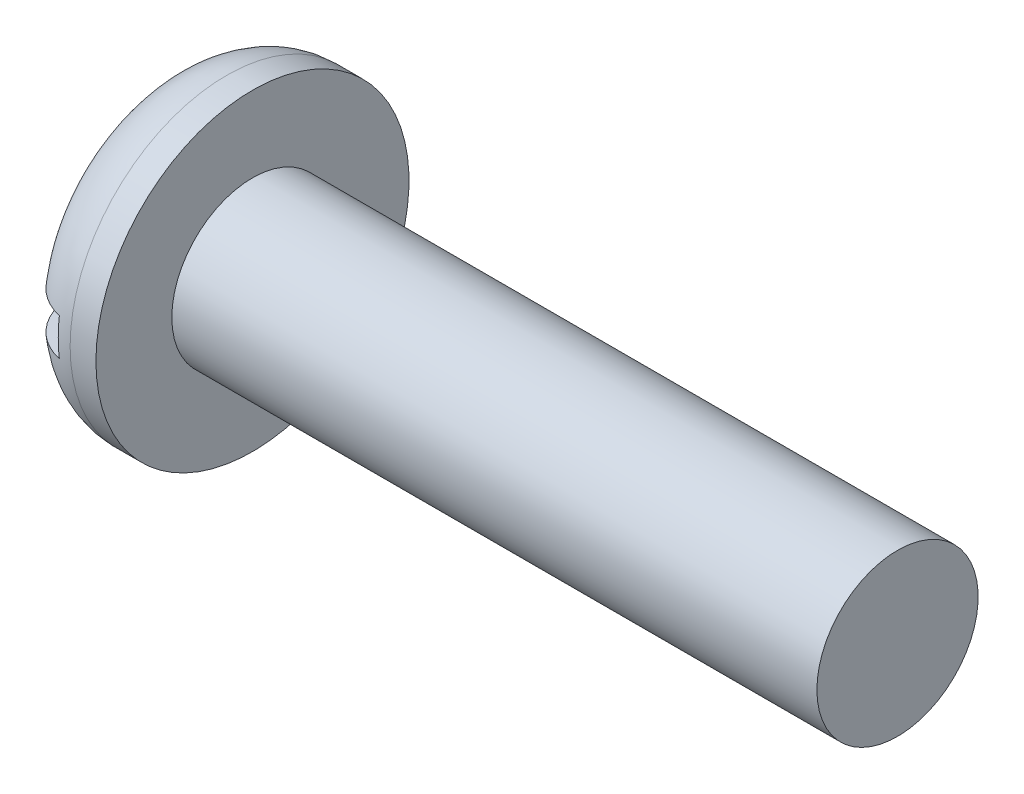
ISO-10303-21;
HEADER;
FILE_DESCRIPTION(('STEP AP214'),'2;1');
FILE_NAME('part.step','',(''),(''),'','','');
FILE_SCHEMA(('AUTOMOTIVE_DESIGN { 1 0 10303 214 1 1 1 1 }'));
ENDSEC;
DATA;
#1=APPLICATION_CONTEXT('core data for automotive mechanical design processes');
#2=APPLICATION_PROTOCOL_DEFINITION('international standard','automotive_design',2000,#1);
#3=PRODUCT_CONTEXT('',#1,'mechanical');
#4=PRODUCT('Part','Part','',(#3));
#5=PRODUCT_RELATED_PRODUCT_CATEGORY('part','',(#4));
#6=PRODUCT_DEFINITION_FORMATION('','',#4);
#7=PRODUCT_DEFINITION_CONTEXT('part definition',#1,'design');
#8=PRODUCT_DEFINITION('design','',#6,#7);
#9=PRODUCT_DEFINITION_SHAPE('','',#8);
#10=(LENGTH_UNIT() NAMED_UNIT(*) SI_UNIT(.MILLI.,.METRE.));
#11=(NAMED_UNIT(*) PLANE_ANGLE_UNIT() SI_UNIT($,.RADIAN.));
#12=(NAMED_UNIT(*) SI_UNIT($,.STERADIAN.) SOLID_ANGLE_UNIT());
#13=UNCERTAINTY_MEASURE_WITH_UNIT(LENGTH_MEASURE(1.E-05),#10,'distance_accuracy_value','');
#14=(GEOMETRIC_REPRESENTATION_CONTEXT(3) GLOBAL_UNCERTAINTY_ASSIGNED_CONTEXT((#13)) GLOBAL_UNIT_ASSIGNED_CONTEXT((#10,
#11,#12)) REPRESENTATION_CONTEXT('',''));
#15=CARTESIAN_POINT('',(0.,0.,0.));
#16=DIRECTION('',(0.,0.,1.));
#17=DIRECTION('',(1.,0.,0.));
#18=AXIS2_PLACEMENT_3D('',#15,#16,#17);
#19=CARTESIAN_POINT('',(0.,0.,0.));
#20=DIRECTION('',(-1.,0.,0.));
#21=DIRECTION('',(0.,0.,1.));
#22=AXIS2_PLACEMENT_3D('',#19,#20,#21);
#23=PLANE('',#22);
#24=DIRECTION('',(0.,0.,-1.));
#25=VECTOR('',#24,1.);
#26=CARTESIAN_POINT('',(0.,1.1049,9.2456));
#27=LINE('',#26,#25);
#28=CARTESIAN_POINT('',(0.,1.1049,5.50358569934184));
#29=VERTEX_POINT('',#28);
#30=CARTESIAN_POINT('',(0.,1.1049,-5.50358569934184));
#31=VERTEX_POINT('',#30);
#32=EDGE_CURVE('E87',#29,#31,#27,.T.);
#33=ORIENTED_EDGE('',*,*,#32,.F.);
#34=CARTESIAN_POINT('',(0.,0.,0.));
#35=DIRECTION('',(-1.,0.,0.));
#36=DIRECTION('',(0.,0.,1.));
#37=AXIS2_PLACEMENT_3D('',#34,#35,#36);
#38=CIRCLE('',#37,5.61339999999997);
#39=EDGE_CURVE('E94',#29,#31,#38,.T.);
#40=ORIENTED_EDGE('',*,*,#39,.T.);
#41=EDGE_LOOP('',(#33,#40));
#42=FACE_BOUND('',#41,.T.);
#43=ADVANCED_FACE('F33',(#42),#23,.T.);
#44=CARTESIAN_POINT('',(-25.4,0.,0.));
#45=DIRECTION('',(-1.,0.,0.));
#46=DIRECTION('',(0.,0.,1.));
#47=AXIS2_PLACEMENT_3D('',#44,#45,#46);
#48=CYLINDRICAL_SURFACE('',#47,4.7625);
#49=CARTESIAN_POINT('',(43.2562,0.,0.));
#50=DIRECTION('',(-1.,0.,0.));
#51=DIRECTION('',(0.,0.,1.));
#52=AXIS2_PLACEMENT_3D('',#49,#50,#51);
#53=CIRCLE('',#52,4.7625);
#54=CARTESIAN_POINT('',(43.2562,0.,4.7625));
#55=VERTEX_POINT('',#54);
#56=EDGE_CURVE('E98',#55,#55,#53,.T.);
#57=ORIENTED_EDGE('',*,*,#56,.T.);
#58=EDGE_LOOP('',(#57));
#59=FACE_BOUND('',#58,.T.);
#60=CARTESIAN_POINT('',(5.1562,0.,0.));
#61=DIRECTION('',(-1.,0.,0.));
#62=DIRECTION('',(0.,0.,1.));
#63=AXIS2_PLACEMENT_3D('',#60,#61,#62);
#64=CIRCLE('',#63,4.7625);
#65=CARTESIAN_POINT('',(5.1562,0.,4.7625));
#66=VERTEX_POINT('',#65);
#67=EDGE_CURVE('E164',#66,#66,#64,.T.);
#68=ORIENTED_EDGE('',*,*,#67,.F.);
#69=EDGE_LOOP('',(#68));
#70=FACE_BOUND('',#69,.T.);
#71=ADVANCED_FACE('F35',(#59,#70),#48,.T.);
#72=CARTESIAN_POINT('',(43.2562,4.7625,0.));
#73=DIRECTION('',(1.,0.,0.));
#74=DIRECTION('',(0.,0.,-1.));
#75=AXIS2_PLACEMENT_3D('',#72,#73,#74);
#76=PLANE('',#75);
#77=ORIENTED_EDGE('',*,*,#56,.F.);
#78=EDGE_LOOP('',(#77));
#79=FACE_BOUND('',#78,.T.);
#80=ADVANCED_FACE('F150',(#79),#76,.T.);
#81=DIRECTION('',(0.,0.,1.));
#82=VECTOR('',#81,1.);
#83=CARTESIAN_POINT('',(0.,-1.1049,-9.2456));
#84=LINE('',#83,#82);
#85=CARTESIAN_POINT('',(0.,-1.1049,-5.50358569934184));
#86=VERTEX_POINT('',#85);
#87=CARTESIAN_POINT('',(0.,-1.1049,5.50358569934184));
#88=VERTEX_POINT('',#87);
#89=EDGE_CURVE('E78',#86,#88,#84,.T.);
#90=ORIENTED_EDGE('',*,*,#89,.F.);
#91=EDGE_CURVE('E85',#86,#88,#38,.T.);
#92=ORIENTED_EDGE('',*,*,#91,.T.);
#93=EDGE_LOOP('',(#90,#92));
#94=FACE_BOUND('',#93,.T.);
#95=ADVANCED_FACE('F84',(#94),#23,.T.);
#96=CARTESIAN_POINT('',(3.6322,0.,0.));
#97=DIRECTION('',(-1.,0.,0.));
#98=DIRECTION('',(0.,0.,1.));
#99=AXIS2_PLACEMENT_3D('',#96,#97,#98);
#100=TOROIDAL_SURFACE('',#99,5.6134,3.6322);
#101=CARTESIAN_POINT('',(1.63607552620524,1.1049,-8.57705458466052));
#102=CARTESIAN_POINT('',(1.80526582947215,1.1049,-8.68926175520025));
#103=CARTESIAN_POINT('',(1.98396739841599,1.1049,-8.78725504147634));
#104=CARTESIAN_POINT('',(2.3553557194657,1.1049,-8.95190398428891));
#105=CARTESIAN_POINT('',(2.54805035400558,1.1049,-9.0185418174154));
#106=CARTESIAN_POINT('',(2.94188428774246,1.1049,-9.11847781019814));
#107=CARTESIAN_POINT('',(3.14302251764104,1.1049,-9.15178017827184));
#108=CARTESIAN_POINT('',(3.54801035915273,1.1049,-9.18407676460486));
#109=CARTESIAN_POINT('',(3.75185965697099,1.1049,-9.18307491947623));
#110=CARTESIAN_POINT('',(4.15616800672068,1.1049,-9.14683312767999));
#111=CARTESIAN_POINT('',(4.3566318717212,1.1049,-9.11164684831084));
#112=CARTESIAN_POINT('',(4.74881439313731,1.1049,-9.00813904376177));
#113=CARTESIAN_POINT('',(4.94053295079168,1.1049,-8.93981714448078));
#114=CARTESIAN_POINT('',(5.30993606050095,1.1049,-8.77196616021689));
#115=CARTESIAN_POINT('',(5.4876111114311,1.1049,-8.67241617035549));
#116=CARTESIAN_POINT('',(5.82380755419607,1.1049,-8.44500778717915));
#117=CARTESIAN_POINT('',(5.9823287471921,1.1049,-8.3171491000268));
#118=CARTESIAN_POINT('',(6.27640711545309,1.1049,-8.0362598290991));
#119=CARTESIAN_POINT('',(6.41187319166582,1.1049,-7.88313389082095));
#120=CARTESIAN_POINT('',(6.6554063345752,1.1049,-7.55646535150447));
#121=CARTESIAN_POINT('',(6.76347271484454,1.1049,-7.38292223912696));
#122=CARTESIAN_POINT('',(6.95010924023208,1.1049,-7.01891475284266));
#123=CARTESIAN_POINT('',(7.02844025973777,1.1049,-6.82832782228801));
#124=CARTESIAN_POINT('',(7.15245956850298,1.1049,-6.43682674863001));
#125=CARTESIAN_POINT('',(7.19814648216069,1.1049,-6.23591217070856));
#126=CARTESIAN_POINT('',(7.25634122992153,1.1049,-5.82655837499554));
#127=CARTESIAN_POINT('',(7.26839014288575,1.1049,-5.61805402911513));
#128=CARTESIAN_POINT('',(7.2580922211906,1.1049,-5.2019075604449));
#129=CARTESIAN_POINT('',(7.23574166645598,1.1049,-4.99426553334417));
#130=CARTESIAN_POINT('',(7.15687981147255,1.1049,-4.58085244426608));
#131=CARTESIAN_POINT('',(7.09962865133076,1.1049,-4.37522275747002));
#132=CARTESIAN_POINT('',(6.95249019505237,1.1049,-3.97603617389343));
#133=CARTESIAN_POINT('',(6.86260203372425,1.1049,-3.78247959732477));
#134=CARTESIAN_POINT('',(6.64974865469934,1.1049,-3.40631444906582));
#135=CARTESIAN_POINT('',(6.52582230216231,1.1049,-3.22424991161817));
#136=CARTESIAN_POINT('',(6.24994692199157,1.1049,-2.88255327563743));
#137=CARTESIAN_POINT('',(6.09797544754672,1.1049,-2.72293932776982));
#138=CARTESIAN_POINT('',(5.76501682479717,1.1049,-2.42613946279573));
#139=CARTESIAN_POINT('',(5.58328741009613,1.1049,-2.2897839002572));
#140=CARTESIAN_POINT('',(5.1987736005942,1.1049,-2.05099614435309));
#141=CARTESIAN_POINT('',(4.99600969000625,1.1049,-1.94853134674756));
#142=CARTESIAN_POINT('',(4.61900755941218,1.1049,-1.80192684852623));
#143=CARTESIAN_POINT('',(4.44781689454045,1.1049,-1.75003208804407));
#144=CARTESIAN_POINT('',(4.18654832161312,1.1049,-1.69423880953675));
#145=CARTESIAN_POINT('',(4.09874661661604,1.1049,-1.67931737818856));
#146=CARTESIAN_POINT('',(3.92215864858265,1.1049,-1.65714370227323));
#147=CARTESIAN_POINT('',(3.83337238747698,1.1049,-1.64989144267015));
#148=CARTESIAN_POINT('',(3.6552720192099,1.1049,-1.64325973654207));
#149=CARTESIAN_POINT('',(3.56595713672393,1.1049,-1.64390120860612));
#150=CARTESIAN_POINT('',(3.38773639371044,1.1049,-1.65308580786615));
#151=CARTESIAN_POINT('',(3.29883053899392,1.1049,-1.66162904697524));
#152=CARTESIAN_POINT('',(3.12203181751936,1.1049,-1.68639293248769));
#153=CARTESIAN_POINT('',(3.03413972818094,1.1049,-1.70261911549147));
#154=CARTESIAN_POINT('',(2.86000419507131,1.1049,-1.74235181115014));
#155=CARTESIAN_POINT('',(2.77376146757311,1.1049,-1.76586141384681));
#156=CARTESIAN_POINT('',(2.52224872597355,1.1049,-1.84535099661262));
#157=CARTESIAN_POINT('',(2.35993271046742,1.1049,-1.91093219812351));
#158=CARTESIAN_POINT('',(2.04639331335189,1.1049,-2.06442145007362));
#159=CARTESIAN_POINT('',(1.89517346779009,1.1049,-2.1523365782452));
#160=CARTESIAN_POINT('',(1.58142490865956,1.1049,-2.36405881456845));
#161=CARTESIAN_POINT('',(1.42128173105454,1.1049,-2.49141723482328));
#162=CARTESIAN_POINT('',(1.12209189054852,1.1049,-2.76889598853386));
#163=CARTESIAN_POINT('',(0.983054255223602,1.1049,-2.91902600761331));
#164=CARTESIAN_POINT('',(0.716298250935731,1.1049,-3.25494550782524));
#165=CARTESIAN_POINT('',(0.591176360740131,1.1049,-3.44280971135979));
#166=CARTESIAN_POINT('',(0.374455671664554,1.1049,-3.83700356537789));
#167=CARTESIAN_POINT('',(0.282858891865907,1.1049,-4.04333432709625));
#168=CARTESIAN_POINT('',(0.136971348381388,1.1049,-4.46746256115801));
#169=CARTESIAN_POINT('',(0.0824628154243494,1.1049,-4.68518487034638));
#170=CARTESIAN_POINT('',(0.0122210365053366,1.1049,-5.12680374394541));
#171=CARTESIAN_POINT('',(-0.00351945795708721,1.1049,-5.35069914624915));
#172=CARTESIAN_POINT('',(0.00469493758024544,1.1049,-5.78995108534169));
#173=CARTESIAN_POINT('',(0.0272859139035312,1.1049,-6.00533334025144));
#174=CARTESIAN_POINT('',(0.109357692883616,1.1049,-6.42898648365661));
#175=CARTESIAN_POINT('',(0.168837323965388,1.1049,-6.63725759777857));
#176=CARTESIAN_POINT('',(0.321112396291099,1.1049,-7.03477289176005));
#177=CARTESIAN_POINT('',(0.412964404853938,1.1049,-7.22437908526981));
#178=CARTESIAN_POINT('',(0.627700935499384,1.1049,-7.58500928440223));
#179=CARTESIAN_POINT('',(0.750562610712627,1.1049,-7.75604683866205));
#180=CARTESIAN_POINT('',(0.995985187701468,1.1049,-8.04205335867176));
#181=CARTESIAN_POINT('',(1.11354304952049,1.1049,-8.16135566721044));
#182=CARTESIAN_POINT('',(1.3639440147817,1.1049,-8.38266766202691));
#183=CARTESIAN_POINT('',(1.49678654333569,1.1049,-8.48467799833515));
#184=CARTESIAN_POINT('',(1.63607552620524,1.1049,-8.57705458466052));
#185=B_SPLINE_CURVE_WITH_KNOTS('',3,(#101,#102,#103,#104,#105,#106,#107,#108,#109,#110,#111,
#112,#113,#114,#115,#116,#117,#118,#119,#120,#121,#122,#123,#124,#125,#126,#127,#128,#129,#130,
#131,#132,#133,#134,#135,#136,#137,#138,#139,#140,#141,#142,#143,#144,#145,#146,#147,#148,#149,
#150,#151,#152,#153,#154,#155,#156,#157,#158,#159,#160,#161,#162,#163,#164,#165,#166,#167,#168,
#169,#170,#171,#172,#173,#174,#175,#176,#177,#178,#179,#180,#181,#182,#183,#184),.UNSPECIFIED.,
.T.,.F.,(4,2,2,2,2,2,2,2,2,2,2,2,2,2,2,2,2,2,2,2,2,2,2,2,2,2,2,2,2,2,2,2,2,2,2,2,2,2,2,2,2,4),
(0.,0.608452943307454,1.21725133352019,1.82597285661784,2.43462452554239,3.04232219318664,
3.65002672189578,4.25813893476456,4.86625745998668,5.47672573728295,6.08720930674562,
6.70250319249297,7.31782300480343,7.94149749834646,8.56523944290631,9.2026875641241,
9.84015258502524,10.4978932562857,11.1561626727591,11.8344646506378,12.5121121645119,
13.0463112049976,13.3132038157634,13.5800959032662,13.8476954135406,14.1152987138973,
14.3830951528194,14.6510053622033,15.1740473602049,15.6972553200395,16.3085922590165,
16.920189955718,17.5940991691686,18.26804896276,18.9380065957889,19.6078389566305,
20.2543337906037,20.900808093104,21.5298179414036,22.1583657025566,22.6593044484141,
23.1602243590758),.UNSPECIFIED.);
#186=CARTESIAN_POINT('',(2.8448,1.1049,-9.09233780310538));
#187=VERTEX_POINT('',#186);
#188=EDGE_CURVE('E11',#31,#187,#185,.T.);
#189=ORIENTED_EDGE('',*,*,#188,.F.);
#190=ORIENTED_EDGE('',*,*,#39,.F.);
#191=CARTESIAN_POINT('',(1.64675908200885,1.1049,2.32243714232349));
#192=CARTESIAN_POINT('',(1.732607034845,1.1049,2.26037977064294));
#193=CARTESIAN_POINT('',(1.82093790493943,1.1049,2.20180710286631));
#194=CARTESIAN_POINT('',(2.00214295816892,1.1049,2.0921771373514));
#195=CARTESIAN_POINT('',(2.09501819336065,1.1049,2.04112159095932));
#196=CARTESIAN_POINT('',(2.37967545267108,1.1049,1.90036256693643));
#197=CARTESIAN_POINT('',(2.57783737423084,1.1049,1.82281187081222));
#198=CARTESIAN_POINT('',(2.86489106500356,1.1049,1.74118401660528));
#199=CARTESIAN_POINT('',(2.94939764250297,1.1049,1.72073473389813));
#200=CARTESIAN_POINT('',(3.11980226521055,1.1049,1.68686373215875));
#201=CARTESIAN_POINT('',(3.2056996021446,1.1049,1.67343854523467));
#202=CARTESIAN_POINT('',(3.37824560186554,1.1049,1.65395231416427));
#203=CARTESIAN_POINT('',(3.46489352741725,1.1049,1.64788472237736));
#204=CARTESIAN_POINT('',(3.63839363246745,1.1049,1.64324900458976));
#205=CARTESIAN_POINT('',(3.72524581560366,1.1049,1.64468101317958));
#206=CARTESIAN_POINT('',(3.89845655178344,1.1049,1.65500640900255));
#207=CARTESIAN_POINT('',(3.98481535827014,1.1049,1.66389553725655));
#208=CARTESIAN_POINT('',(4.15649235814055,1.1049,1.68889366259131));
#209=CARTESIAN_POINT('',(4.24181014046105,1.1049,1.70500542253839));
#210=CARTESIAN_POINT('',(4.49548303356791,1.1049,1.76367524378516));
#211=CARTESIAN_POINT('',(4.66153293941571,1.1049,1.81656621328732));
#212=CARTESIAN_POINT('',(4.98999854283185,1.1049,1.9486824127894));
#213=CARTESIAN_POINT('',(5.15203257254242,1.1049,2.02883716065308));
#214=CARTESIAN_POINT('',(5.46312260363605,1.1049,2.21121021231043));
#215=CARTESIAN_POINT('',(5.61217550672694,1.1049,2.31343376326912));
#216=CARTESIAN_POINT('',(5.91965991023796,1.1049,2.55656949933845));
#217=CARTESIAN_POINT('',(6.07522865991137,1.1049,2.70111723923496));
#218=CARTESIAN_POINT('',(6.36186843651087,1.1049,3.01279576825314));
#219=CARTESIAN_POINT('',(6.49292966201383,1.1049,3.17993554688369));
#220=CARTESIAN_POINT('',(6.73501943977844,1.1049,3.54487010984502));
#221=CARTESIAN_POINT('',(6.84408271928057,1.1049,3.74397595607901));
#222=CARTESIAN_POINT('',(7.02644512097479,1.1049,4.15796624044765));
#223=CARTESIAN_POINT('',(7.09974582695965,1.1049,4.37284997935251));
#224=CARTESIAN_POINT('',(7.20658482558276,1.1049,4.80771718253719));
#225=CARTESIAN_POINT('',(7.2408946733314,1.1049,5.02751060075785));
#226=CARTESIAN_POINT('',(7.27071268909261,1.1049,5.46972279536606));
#227=CARTESIAN_POINT('',(7.26622765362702,1.1049,5.69214110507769));
#228=CARTESIAN_POINT('',(7.21890822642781,1.1049,6.12514189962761));
#229=CARTESIAN_POINT('',(7.17739276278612,1.1049,6.33586883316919));
#230=CARTESIAN_POINT('',(7.05867649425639,1.1049,6.74702277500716));
#231=CARTESIAN_POINT('',(6.98148084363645,1.1049,6.94745126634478));
#232=CARTESIAN_POINT('',(6.79575077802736,1.1049,7.32716585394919));
#233=CARTESIAN_POINT('',(6.68802560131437,1.1049,7.5068480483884));
#234=CARTESIAN_POINT('',(6.44350901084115,1.1049,7.8452106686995));
#235=CARTESIAN_POINT('',(6.30672017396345,1.1049,8.00389295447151));
#236=CARTESIAN_POINT('',(6.0102008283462,1.1049,8.29330702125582));
#237=CARTESIAN_POINT('',(5.85084102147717,1.1049,8.42441874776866));
#238=CARTESIAN_POINT('',(5.51221346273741,1.1049,8.65775229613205));
#239=CARTESIAN_POINT('',(5.33294673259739,1.1049,8.75997559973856));
#240=CARTESIAN_POINT('',(4.96125064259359,1.1049,8.9317616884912));
#241=CARTESIAN_POINT('',(4.76894624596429,1.1049,9.00159494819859));
#242=CARTESIAN_POINT('',(4.37531534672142,1.1049,9.10783086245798));
#243=CARTESIAN_POINT('',(4.17398909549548,1.1049,9.14423444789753));
#244=CARTESIAN_POINT('',(3.76894274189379,1.1049,9.18246092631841));
#245=CARTESIAN_POINT('',(3.56523637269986,1.1049,9.18442948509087));
#246=CARTESIAN_POINT('',(3.16039199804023,1.1049,9.15410266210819));
#247=CARTESIAN_POINT('',(2.95925396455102,1.1049,9.1218076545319));
#248=CARTESIAN_POINT('',(2.56545031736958,1.1049,9.02394334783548));
#249=CARTESIAN_POINT('',(2.37277677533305,1.1049,8.95840594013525));
#250=CARTESIAN_POINT('',(2.00113622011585,1.1049,8.7959785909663));
#251=CARTESIAN_POINT('',(1.82216923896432,1.1049,8.69908857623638));
#252=CARTESIAN_POINT('',(1.48259920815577,1.1049,8.47652736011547));
#253=CARTESIAN_POINT('',(1.32203509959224,1.1049,8.35079675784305));
#254=CARTESIAN_POINT('',(1.02415409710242,1.1049,8.07429881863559));
#255=CARTESIAN_POINT('',(0.886837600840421,1.1049,7.9235310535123));
#256=CARTESIAN_POINT('',(0.638490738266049,1.1049,7.60037859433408));
#257=CARTESIAN_POINT('',(0.5276103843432,1.1049,7.42787864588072));
#258=CARTESIAN_POINT('',(0.336055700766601,1.1049,7.06686137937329));
#259=CARTESIAN_POINT('',(0.255382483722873,1.1049,6.87834347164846));
#260=CARTESIAN_POINT('',(0.125575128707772,1.1049,6.48860746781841));
#261=CARTESIAN_POINT('',(0.0767719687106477,1.1049,6.28727920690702));
#262=CARTESIAN_POINT('',(0.0130576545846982,1.1049,5.87934816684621));
#263=CARTESIAN_POINT('',(-0.0018522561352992,1.1049,5.67274519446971));
#264=CARTESIAN_POINT('',(0.00225438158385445,1.1049,5.25637792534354));
#265=CARTESIAN_POINT('',(0.0218513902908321,1.1049,5.04661952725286));
#266=CARTESIAN_POINT('',(0.095058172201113,1.1049,4.63311250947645));
#267=CARTESIAN_POINT('',(0.148675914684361,1.1049,4.42936530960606));
#268=CARTESIAN_POINT('',(0.289815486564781,1.1049,4.02783878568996));
#269=CARTESIAN_POINT('',(0.378208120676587,1.1049,3.83036611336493));
#270=CARTESIAN_POINT('',(0.585782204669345,1.1049,3.45243478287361));
#271=CARTESIAN_POINT('',(0.704951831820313,1.1049,3.27196962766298));
#272=CARTESIAN_POINT('',(0.953444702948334,1.1049,2.95425588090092));
#273=CARTESIAN_POINT('',(1.07950365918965,1.1049,2.81443321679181));
#274=CARTESIAN_POINT('',(1.35001627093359,1.1049,2.55355668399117));
#275=CARTESIAN_POINT('',(1.49448157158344,1.1049,2.43251480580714));
#276=CARTESIAN_POINT('',(1.64675908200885,1.1049,2.32243714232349));
#277=B_SPLINE_CURVE_WITH_KNOTS('',3,(#191,#192,#193,#194,#195,#196,#197,#198,#199,#200,#201,
#202,#203,#204,#205,#206,#207,#208,#209,#210,#211,#212,#213,#214,#215,#216,#217,#218,#219,#220,
#221,#222,#223,#224,#225,#226,#227,#228,#229,#230,#231,#232,#233,#234,#235,#236,#237,#238,#239,
#240,#241,#242,#243,#244,#245,#246,#247,#248,#249,#250,#251,#252,#253,#254,#255,#256,#257,#258,
#259,#260,#261,#262,#263,#264,#265,#266,#267,#268,#269,#270,#271,#272,#273,#274,#275,#276),
.UNSPECIFIED.,.T.,.F.,(4,2,2,2,2,2,2,2,2,2,2,2,2,2,2,2,2,2,2,2,2,2,2,2,2,2,2,2,2,2,2,2,2,2,2,2,
2,2,2,2,2,2,4),(0.,0.317619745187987,0.63531337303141,1.26942079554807,1.53004517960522,
1.79054076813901,2.05080436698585,2.31107263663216,2.57119236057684,2.8314116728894,
3.35192380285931,3.89233653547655,4.43287790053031,5.06724287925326,5.70186102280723,
6.37958329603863,7.05727555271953,7.72131039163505,8.38522889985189,9.02640473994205,
9.66748798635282,10.2929541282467,10.9183648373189,11.5344916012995,12.1505867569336,
12.7614402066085,13.3722766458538,13.9805285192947,14.5887737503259,15.1964365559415,
15.8041007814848,16.4130279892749,17.0219656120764,17.6342805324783,18.2466180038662,
18.8652176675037,19.4838400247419,20.1129682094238,20.7422438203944,21.3883979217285,
22.034304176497,22.5973416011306,23.1607370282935),.UNSPECIFIED.);
#278=CARTESIAN_POINT('',(2.8448,1.1049,9.09233780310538));
#279=VERTEX_POINT('',#278);
#280=EDGE_CURVE('E113',#279,#29,#277,.T.);
#281=ORIENTED_EDGE('',*,*,#280,.F.);
#282=CARTESIAN_POINT('',(2.8448,0.,0.));
#283=DIRECTION('',(-1.,0.,0.));
#284=DIRECTION('',(0.,0.,1.));
#285=AXIS2_PLACEMENT_3D('',#282,#283,#284);
#286=CIRCLE('',#285,9.1592254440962);
#287=CARTESIAN_POINT('',(2.8448,-1.1049,9.09233780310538));
#288=VERTEX_POINT('',#287);
#289=EDGE_CURVE('E106',#279,#288,#286,.F.);
#290=ORIENTED_EDGE('',*,*,#289,.T.);
#291=CARTESIAN_POINT('',(1.64675908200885,-1.1049,2.32243714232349));
#292=CARTESIAN_POINT('',(1.46458177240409,-1.1049,2.45413225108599));
#293=CARTESIAN_POINT('',(1.2936493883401,-1.1049,2.60144509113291));
#294=CARTESIAN_POINT('',(0.978318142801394,-1.1049,2.92272515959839));
#295=CARTESIAN_POINT('',(0.833978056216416,-1.1049,3.09674990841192));
#296=CARTESIAN_POINT('',(0.57620629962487,-1.1049,3.46692084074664));
#297=CARTESIAN_POINT('',(0.462836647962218,-1.1049,3.66311031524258));
#298=CARTESIAN_POINT('',(0.271318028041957,-1.1049,4.07186406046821));
#299=CARTESIAN_POINT('',(0.193144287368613,-1.1049,4.28441669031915));
#300=CARTESIAN_POINT('',(0.075855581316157,-1.1049,4.71654704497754));
#301=CARTESIAN_POINT('',(0.0361572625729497,-1.1049,4.93596603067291));
#302=CARTESIAN_POINT('',(-0.00441457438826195,-1.1049,5.3784083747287));
#303=CARTESIAN_POINT('',(-0.00528894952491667,-1.1049,5.60143165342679));
#304=CARTESIAN_POINT('',(0.0317084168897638,-1.1049,6.03646043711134));
#305=CARTESIAN_POINT('',(0.0682405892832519,-1.1049,6.24858016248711));
#306=CARTESIAN_POINT('',(0.177332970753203,-1.1049,6.66334159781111));
#307=CARTESIAN_POINT('',(0.249886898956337,-1.1049,6.86598495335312));
#308=CARTESIAN_POINT('',(0.426864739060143,-1.1049,7.25067061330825));
#309=CARTESIAN_POINT('',(0.530442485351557,-1.1049,7.43310248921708));
#310=CARTESIAN_POINT('',(0.767210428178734,-1.1049,7.77761866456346));
#311=CARTESIAN_POINT('',(0.900397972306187,-1.1049,7.93970478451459));
#312=CARTESIAN_POINT('',(1.19033808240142,-1.1049,8.23633535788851));
#313=CARTESIAN_POINT('',(1.34669639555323,-1.1049,8.37126532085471));
#314=CARTESIAN_POINT('',(1.68001819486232,-1.1049,8.61267733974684));
#315=CARTESIAN_POINT('',(1.85698059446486,-1.1049,8.71916089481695));
#316=CARTESIAN_POINT('',(2.22478185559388,-1.1049,8.89971011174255));
#317=CARTESIAN_POINT('',(2.41548380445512,-1.1049,8.97405477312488));
#318=CARTESIAN_POINT('',(2.80669542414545,-1.1049,9.08951002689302));
#319=CARTESIAN_POINT('',(3.00720480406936,-1.1049,9.13062160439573));
#320=CARTESIAN_POINT('',(3.41137470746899,-1.1049,9.17829538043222));
#321=CARTESIAN_POINT('',(3.61501707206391,-1.1049,9.18501165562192));
#322=CARTESIAN_POINT('',(4.02053136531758,-1.1049,9.16411592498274));
#323=CARTESIAN_POINT('',(4.22240331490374,-1.1049,9.13650432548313));
#324=CARTESIAN_POINT('',(4.6184048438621,-1.1049,9.04781135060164));
#325=CARTESIAN_POINT('',(4.81254319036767,-1.1049,8.98676910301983));
#326=CARTESIAN_POINT('',(5.1878423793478,-1.1049,8.83301615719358));
#327=CARTESIAN_POINT('',(5.36900320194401,-1.1049,8.74030541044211));
#328=CARTESIAN_POINT('',(5.71358971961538,-1.1049,8.52569897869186));
#329=CARTESIAN_POINT('',(5.87698174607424,-1.1049,8.40374924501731));
#330=CARTESIAN_POINT('',(6.18110330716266,-1.1049,8.13428111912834));
#331=CARTESIAN_POINT('',(6.3218324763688,-1.1049,7.98676231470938));
#332=CARTESIAN_POINT('',(6.57747096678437,-1.1049,7.66954513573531));
#333=CARTESIAN_POINT('',(6.69224004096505,-1.1049,7.49973376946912));
#334=CARTESIAN_POINT('',(6.8919523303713,-1.1049,7.14340481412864));
#335=CARTESIAN_POINT('',(6.97689457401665,-1.1049,6.95688668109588));
#336=CARTESIAN_POINT('',(7.11550854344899,-1.1049,6.57050412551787));
#337=CARTESIAN_POINT('',(7.16886437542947,-1.1049,6.37052644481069));
#338=CARTESIAN_POINT('',(7.24182570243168,-1.1049,5.96452068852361));
#339=CARTESIAN_POINT('',(7.26142937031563,-1.1049,5.75849228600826));
#340=CARTESIAN_POINT('',(7.26678738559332,-1.1049,5.34261264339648));
#341=CARTESIAN_POINT('',(7.25197911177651,-1.1049,5.13275431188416));
#342=CARTESIAN_POINT('',(7.18824709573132,-1.1049,4.71829488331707));
#343=CARTESIAN_POINT('',(7.13931889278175,-1.1049,4.51369447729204));
#344=CARTESIAN_POINT('',(7.00750465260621,-1.1049,4.10987139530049));
#345=CARTESIAN_POINT('',(6.92377093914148,-1.1049,3.91092575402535));
#346=CARTESIAN_POINT('',(6.72518920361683,-1.1049,3.52925794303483));
#347=CARTESIAN_POINT('',(6.61034005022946,-1.1049,3.34653636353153));
#348=CARTESIAN_POINT('',(6.34857865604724,-1.1049,2.99588882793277));
#349=CARTESIAN_POINT('',(6.20070493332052,-1.1049,2.82868176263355));
#350=CARTESIAN_POINT('',(5.87913806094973,-1.1049,2.52062648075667));
#351=CARTESIAN_POINT('',(5.70541484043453,-1.1049,2.37980940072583));
#352=CARTESIAN_POINT('',(5.4275105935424,-1.1049,2.19137596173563));
#353=CARTESIAN_POINT('',(5.33114203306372,-1.1049,2.13198045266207));
#354=CARTESIAN_POINT('',(5.13340772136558,-1.1049,2.02207886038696));
#355=CARTESIAN_POINT('',(5.03204167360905,-1.1049,1.9715733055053));
#356=CARTESIAN_POINT('',(4.82516615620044,-1.1049,1.88045271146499));
#357=CARTESIAN_POINT('',(4.71966449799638,-1.1049,1.83981997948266));
#358=CARTESIAN_POINT('',(4.50512922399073,-1.1049,1.76932399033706));
#359=CARTESIAN_POINT('',(4.39609678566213,-1.1049,1.739457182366));
#360=CARTESIAN_POINT('',(4.1873156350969,-1.1049,1.69402927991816));
#361=CARTESIAN_POINT('',(4.08782618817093,-1.1049,1.67727699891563));
#362=CARTESIAN_POINT('',(3.8876804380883,-1.1049,1.65365384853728));
#363=CARTESIAN_POINT('',(3.78702427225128,-1.1049,1.6467818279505));
#364=CARTESIAN_POINT('',(3.58556133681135,-1.1049,1.64316996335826));
#365=CARTESIAN_POINT('',(3.48475463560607,-1.1049,1.64642642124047));
#366=CARTESIAN_POINT('',(3.2839933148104,-1.1049,1.6629304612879));
#367=CARTESIAN_POINT('',(3.18403866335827,-1.1049,1.67617766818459));
#368=CARTESIAN_POINT('',(2.91582156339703,-1.1049,1.72499860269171));
#369=CARTESIAN_POINT('',(2.7491650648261,-1.1049,1.76973247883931));
#370=CARTESIAN_POINT('',(2.4247365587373,-1.1049,1.88363184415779));
#371=CARTESIAN_POINT('',(2.26696004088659,-1.1049,1.95278479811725));
#372=CARTESIAN_POINT('',(1.95201279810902,-1.1049,2.1176284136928));
#373=CARTESIAN_POINT('',(1.79563132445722,-1.1049,2.21481810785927));
#374=CARTESIAN_POINT('',(1.64675908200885,-1.1049,2.32243714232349));
#375=B_SPLINE_CURVE_WITH_KNOTS('',3,(#291,#292,#293,#294,#295,#296,#297,#298,#299,#300,#301,
#302,#303,#304,#305,#306,#307,#308,#309,#310,#311,#312,#313,#314,#315,#316,#317,#318,#319,#320,
#321,#322,#323,#324,#325,#326,#327,#328,#329,#330,#331,#332,#333,#334,#335,#336,#337,#338,#339,
#340,#341,#342,#343,#344,#345,#346,#347,#348,#349,#350,#351,#352,#353,#354,#355,#356,#357,#358,
#359,#360,#361,#362,#363,#364,#365,#366,#367,#368,#369,#370,#371,#372,#373,#374),.UNSPECIFIED.,
.T.,.F.,(4,2,2,2,2,2,2,2,2,2,2,2,2,2,2,2,2,2,2,2,2,2,2,2,2,2,2,2,2,2,2,2,2,2,2,2,2,2,2,2,2,4),
(0.,0.673685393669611,1.34884237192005,2.02534160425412,2.70136393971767,3.3669683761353,
4.03255812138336,4.67511845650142,5.31756679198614,5.94388027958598,6.57013768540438,
7.18675605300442,7.80334191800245,8.41446208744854,9.02556414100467,9.63392630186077,
10.242281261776,10.8499257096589,11.4575710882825,12.0663484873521,12.6751357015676,
13.2871371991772,13.8991586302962,14.5172017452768,15.1352783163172,15.7635311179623,
16.391866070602,17.0364946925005,17.6811467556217,18.3478261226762,19.0152871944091,
19.354521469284,19.6937758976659,20.0324177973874,20.3709479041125,20.6731516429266,
20.9753201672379,21.2773783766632,21.5794252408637,22.0947597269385,22.6098300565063,
23.1603544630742),.UNSPECIFIED.);
#376=EDGE_CURVE('E93',#88,#288,#375,.T.);
#377=ORIENTED_EDGE('',*,*,#376,.F.);
#378=ORIENTED_EDGE('',*,*,#91,.F.);
#379=CARTESIAN_POINT('',(1.63607552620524,-1.1049,-8.57705458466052));
#380=CARTESIAN_POINT('',(1.46545008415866,-1.1049,-8.46387716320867));
#381=CARTESIAN_POINT('',(1.30429767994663,-1.1049,-8.33610472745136));
#382=CARTESIAN_POINT('',(1.00565958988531,-1.1049,-8.05512890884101));
#383=CARTESIAN_POINT('',(0.868207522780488,-1.1049,-7.90188999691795));
#384=CARTESIAN_POINT('',(0.621053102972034,-1.1049,-7.5746747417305));
#385=CARTESIAN_POINT('',(0.511325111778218,-1.1049,-7.40071777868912));
#386=CARTESIAN_POINT('',(0.322417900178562,-1.1049,-7.03702486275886));
#387=CARTESIAN_POINT('',(0.243230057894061,-1.1049,-6.84729338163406));
#388=CARTESIAN_POINT('',(0.116805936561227,-1.1049,-6.45581748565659));
#389=CARTESIAN_POINT('',(0.0698272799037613,-1.1049,-6.25398993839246));
#390=CARTESIAN_POINT('',(0.00980744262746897,-1.1049,-5.84535467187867));
#391=CARTESIAN_POINT('',(-0.00323012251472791,-1.1049,-5.63854642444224));
#392=CARTESIAN_POINT('',(0.00465073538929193,-1.1049,-5.22201899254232));
#393=CARTESIAN_POINT('',(0.0261588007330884,-1.1049,-5.01231113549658));
#394=CARTESIAN_POINT('',(0.103139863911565,-1.1049,-4.59924016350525));
#395=CARTESIAN_POINT('',(0.158616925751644,-1.1049,-4.39587781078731));
#396=CARTESIAN_POINT('',(0.303436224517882,-1.1049,-3.99539519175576));
#397=CARTESIAN_POINT('',(0.393650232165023,-1.1049,-3.79859051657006));
#398=CARTESIAN_POINT('',(0.604753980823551,-1.1049,-3.42220825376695));
#399=CARTESIAN_POINT('',(0.725646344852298,-1.1049,-3.24263214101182));
#400=CARTESIAN_POINT('',(0.999167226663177,-1.1049,-2.89931253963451));
#401=CARTESIAN_POINT('',(1.15274359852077,-1.1049,-2.73632522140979));
#402=CARTESIAN_POINT('',(1.48509895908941,-1.1049,-2.43776003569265));
#403=CARTESIAN_POINT('',(1.66390710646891,-1.1049,-2.3022143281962));
#404=CARTESIAN_POINT('',(1.94836737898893,-1.1049,-2.12306872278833));
#405=CARTESIAN_POINT('',(2.04643864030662,-1.1049,-2.06715985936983));
#406=CARTESIAN_POINT('',(2.24732194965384,-1.1049,-1.96450874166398));
#407=CARTESIAN_POINT('',(2.35013423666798,-1.1049,-1.91776695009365));
#408=CARTESIAN_POINT('',(2.5595686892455,-1.1049,-1.83449462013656));
#409=CARTESIAN_POINT('',(2.66618216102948,-1.1049,-1.79794227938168));
#410=CARTESIAN_POINT('',(2.88258671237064,-1.1049,-1.7359148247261));
#411=CARTESIAN_POINT('',(2.99237695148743,-1.1049,-1.71043680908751));
#412=CARTESIAN_POINT('',(3.20047955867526,-1.1049,-1.67384248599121));
#413=CARTESIAN_POINT('',(3.2985503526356,-1.1049,-1.66134916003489));
#414=CARTESIAN_POINT('',(3.49544122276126,-1.1049,-1.64598471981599));
#415=CARTESIAN_POINT('',(3.59426121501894,-1.1049,-1.6431125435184));
#416=CARTESIAN_POINT('',(3.79168227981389,-1.1049,-1.64709371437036));
#417=CARTESIAN_POINT('',(3.89028340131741,-1.1049,-1.65394460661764));
#418=CARTESIAN_POINT('',(4.0863372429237,-1.1049,-1.67711784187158));
#419=CARTESIAN_POINT('',(4.18378997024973,-1.1049,-1.69344012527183));
#420=CARTESIAN_POINT('',(4.44799884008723,-1.1049,-1.75045489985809));
#421=CARTESIAN_POINT('',(4.61285476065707,-1.1049,-1.8002426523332));
#422=CARTESIAN_POINT('',(4.93334676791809,-1.1049,-1.92350375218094));
#423=CARTESIAN_POINT('',(5.08897711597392,-1.1049,-1.99699166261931));
#424=CARTESIAN_POINT('',(5.40838980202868,-1.1049,-2.17537758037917));
#425=CARTESIAN_POINT('',(5.57058233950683,-1.1049,-2.28312429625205));
#426=CARTESIAN_POINT('',(5.87749106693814,-1.1049,-2.52110133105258));
#427=CARTESIAN_POINT('',(6.02220167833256,-1.1049,-2.65133879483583));
#428=CARTESIAN_POINT('',(6.3102617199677,-1.1049,-2.95087743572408));
#429=CARTESIAN_POINT('',(6.45059846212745,-1.1049,-3.12309398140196));
#430=CARTESIAN_POINT('',(6.70101179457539,-1.1049,-3.4883296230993));
#431=CARTESIAN_POINT('',(6.81108132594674,-1.1049,-3.68135355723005));
#432=CARTESIAN_POINT('',(6.99899955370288,-1.1049,-4.0867594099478));
#433=CARTESIAN_POINT('',(7.07623850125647,-1.1049,-4.29942520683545));
#434=CARTESIAN_POINT('',(7.19256742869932,-1.1049,-4.73495779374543));
#435=CARTESIAN_POINT('',(7.23166328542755,-1.1049,-4.95782300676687));
#436=CARTESIAN_POINT('',(7.26922563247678,-1.1049,-5.39963781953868));
#437=CARTESIAN_POINT('',(7.26897484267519,-1.1049,-5.6184782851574));
#438=CARTESIAN_POINT('',(7.23052100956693,-1.1049,-6.05280579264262));
#439=CARTESIAN_POINT('',(7.19232428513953,-1.1049,-6.26829338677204));
#440=CARTESIAN_POINT('',(7.08048773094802,-1.1049,-6.68280216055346));
#441=CARTESIAN_POINT('',(7.00796536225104,-1.1049,-6.88212518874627));
#442=CARTESIAN_POINT('',(6.82982377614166,-1.1049,-7.26539120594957));
#443=CARTESIAN_POINT('',(6.72420845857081,-1.1049,-7.44933600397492));
#444=CARTESIAN_POINT('',(6.48521309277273,-1.1049,-7.79282392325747));
#445=CARTESIAN_POINT('',(6.35242117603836,-1.1049,-7.95277646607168));
#446=CARTESIAN_POINT('',(6.06158087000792,-1.1049,-8.2477852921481));
#447=CARTESIAN_POINT('',(5.90353416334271,-1.1049,-8.38284323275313));
#448=CARTESIAN_POINT('',(5.56868924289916,-1.1049,-8.6226127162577));
#449=CARTESIAN_POINT('',(5.39213125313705,-1.1049,-8.72765985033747));
#450=CARTESIAN_POINT('',(5.02380720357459,-1.1049,-8.90639444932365));
#451=CARTESIAN_POINT('',(4.8320424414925,-1.1049,-8.98008458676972));
#452=CARTESIAN_POINT('',(4.44009616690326,-1.1049,-9.09356370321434));
#453=CARTESIAN_POINT('',(4.23997787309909,-1.1049,-9.1335711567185));
#454=CARTESIAN_POINT('',(3.83580042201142,-1.1049,-9.17932886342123));
#455=CARTESIAN_POINT('',(3.63174024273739,-1.1049,-9.18507010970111));
#456=CARTESIAN_POINT('',(3.22603053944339,-1.1049,-9.16214158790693));
#457=CARTESIAN_POINT('',(3.0243767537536,-1.1049,-9.13354627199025));
#458=CARTESIAN_POINT('',(2.62892934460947,-1.1049,-9.04291218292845));
#459=CARTESIAN_POINT('',(2.43512541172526,-1.1049,-8.98091891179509));
#460=CARTESIAN_POINT('',(2.14109416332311,-1.1049,-8.85880953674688));
#461=CARTESIAN_POINT('',(2.03635096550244,-1.1049,-8.80926961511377));
#462=CARTESIAN_POINT('',(1.83208718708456,-1.1049,-8.70039382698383));
#463=CARTESIAN_POINT('',(1.73256658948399,-1.1049,-8.64105799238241));
#464=CARTESIAN_POINT('',(1.63607552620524,-1.1049,-8.57705458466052));
#465=B_SPLINE_CURVE_WITH_KNOTS('',3,(#379,#380,#381,#382,#383,#384,#385,#386,#387,#388,#389,
#390,#391,#392,#393,#394,#395,#396,#397,#398,#399,#400,#401,#402,#403,#404,#405,#406,#407,#408,
#409,#410,#411,#412,#413,#414,#415,#416,#417,#418,#419,#420,#421,#422,#423,#424,#425,#426,#427,
#428,#429,#430,#431,#432,#433,#434,#435,#436,#437,#438,#439,#440,#441,#442,#443,#444,#445,#446,
#447,#448,#449,#450,#451,#452,#453,#454,#455,#456,#457,#458,#459,#460,#461,#462,#463,#464),
.UNSPECIFIED.,.T.,.F.,(4,2,2,2,2,2,2,2,2,2,2,2,2,2,2,2,2,2,2,2,2,2,2,2,2,2,2,2,2,2,2,2,2,2,2,2,
2,2,2,2,2,2,4),(0.,0.613818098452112,1.22849985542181,1.8426110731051,2.4565487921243,
3.07534148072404,3.69420008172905,4.32373438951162,4.95334402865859,5.59990935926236,
6.24652999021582,6.91537199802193,7.5849933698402,7.92327709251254,8.26157788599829,
8.59914916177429,8.93663193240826,9.23277145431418,9.5288782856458,9.82491036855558,
10.1209405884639,10.635318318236,11.1500127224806,11.7319256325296,12.3140237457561,
12.9774179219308,13.6409666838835,14.3163512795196,14.9916317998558,15.6449025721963,
16.2980645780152,16.9312893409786,17.5644395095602,18.1851130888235,18.8057453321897,
19.4191384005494,20.0324791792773,20.641810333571,21.2513016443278,21.8594737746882,
22.4668194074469,22.8139432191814,23.1610659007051),.UNSPECIFIED.);
#466=CARTESIAN_POINT('',(2.8448,-1.1049,-9.09233780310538));
#467=VERTEX_POINT('',#466);
#468=EDGE_CURVE('E46',#467,#86,#465,.T.);
#469=ORIENTED_EDGE('',*,*,#468,.F.);
#470=EDGE_CURVE('E58',#467,#187,#286,.F.);
#471=ORIENTED_EDGE('',*,*,#470,.T.);
#472=EDGE_LOOP('',(#189,#190,#281,#290,#377,#378,#469,#471));
#473=FACE_BOUND('',#472,.T.);
#474=CARTESIAN_POINT('',(3.63220000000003,0.,0.));
#475=DIRECTION('',(-1.,0.,0.));
#476=DIRECTION('',(0.,0.,1.));
#477=AXIS2_PLACEMENT_3D('',#474,#475,#476);
#478=CIRCLE('',#477,9.2456);
#479=CARTESIAN_POINT('',(3.63220000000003,0.,9.2456));
#480=VERTEX_POINT('',#479);
#481=EDGE_CURVE('E95',#480,#480,#478,.T.);
#482=ORIENTED_EDGE('',*,*,#481,.T.);
#483=EDGE_LOOP('',(#482));
#484=FACE_BOUND('',#483,.T.);
#485=ADVANCED_FACE('F90',(#473,#484),#100,.T.);
#486=CARTESIAN_POINT('',(-25.4,0.,0.));
#487=DIRECTION('',(-1.,0.,0.));
#488=DIRECTION('',(0.,0.,1.));
#489=AXIS2_PLACEMENT_3D('',#486,#487,#488);
#490=CYLINDRICAL_SURFACE('',#489,9.2456);
#491=CARTESIAN_POINT('',(5.1562,0.,0.));
#492=DIRECTION('',(-1.,0.,0.));
#493=DIRECTION('',(0.,0.,1.));
#494=AXIS2_PLACEMENT_3D('',#491,#492,#493);
#495=CIRCLE('',#494,9.2456);
#496=CARTESIAN_POINT('',(5.1562,0.,9.2456));
#497=VERTEX_POINT('',#496);
#498=EDGE_CURVE('E100',#497,#497,#495,.T.);
#499=ORIENTED_EDGE('',*,*,#498,.T.);
#500=EDGE_LOOP('',(#499));
#501=FACE_BOUND('',#500,.T.);
#502=ORIENTED_EDGE('',*,*,#481,.F.);
#503=EDGE_LOOP('',(#502));
#504=FACE_BOUND('',#503,.T.);
#505=ADVANCED_FACE('F136',(#501,#504),#490,.T.);
#506=CARTESIAN_POINT('',(5.1562,4.7625,0.));
#507=DIRECTION('',(-1.,0.,0.));
#508=DIRECTION('',(0.,0.,1.));
#509=AXIS2_PLACEMENT_3D('',#506,#507,#508);
#510=PLANE('',#509);
#511=ORIENTED_EDGE('',*,*,#498,.F.);
#512=EDGE_LOOP('',(#511));
#513=FACE_BOUND('',#512,.T.);
#514=ORIENTED_EDGE('',*,*,#67,.T.);
#515=EDGE_LOOP('',(#514));
#516=FACE_BOUND('',#515,.T.);
#517=ADVANCED_FACE('F132',(#513,#516),#510,.F.);
#518=CARTESIAN_POINT('',(2.8448,1.1049,9.2456));
#519=DIRECTION('',(0.,1.,0.));
#520=DIRECTION('',(0.,0.,1.));
#521=AXIS2_PLACEMENT_3D('',#518,#519,#520);
#522=PLANE('',#521);
#523=ORIENTED_EDGE('',*,*,#188,.T.);
#524=DIRECTION('',(0.,0.,-1.));
#525=VECTOR('',#524,1.);
#526=CARTESIAN_POINT('',(2.8448,1.1049,9.2456));
#527=LINE('',#526,#525);
#528=EDGE_CURVE('E86',#279,#187,#527,.T.);
#529=ORIENTED_EDGE('',*,*,#528,.F.);
#530=ORIENTED_EDGE('',*,*,#280,.T.);
#531=ORIENTED_EDGE('',*,*,#32,.T.);
#532=EDGE_LOOP('',(#523,#529,#530,#531));
#533=FACE_BOUND('',#532,.T.);
#534=ADVANCED_FACE('F124',(#533),#522,.F.);
#535=CARTESIAN_POINT('',(2.8448,-1.1049,-9.2456));
#536=DIRECTION('',(0.,-1.,0.));
#537=DIRECTION('',(0.,0.,-1.));
#538=AXIS2_PLACEMENT_3D('',#535,#536,#537);
#539=PLANE('',#538);
#540=ORIENTED_EDGE('',*,*,#468,.T.);
#541=ORIENTED_EDGE('',*,*,#89,.T.);
#542=ORIENTED_EDGE('',*,*,#376,.T.);
#543=DIRECTION('',(0.,0.,1.));
#544=VECTOR('',#543,1.);
#545=CARTESIAN_POINT('',(2.8448,-1.1049,-9.2456));
#546=LINE('',#545,#544);
#547=EDGE_CURVE('E53',#467,#288,#546,.T.);
#548=ORIENTED_EDGE('',*,*,#547,.F.);
#549=EDGE_LOOP('',(#540,#541,#542,#548));
#550=FACE_BOUND('',#549,.T.);
#551=ADVANCED_FACE('F77',(#550),#539,.F.);
#552=CARTESIAN_POINT('',(2.8448,1.1049,-9.2456));
#553=DIRECTION('',(-1.,0.,0.));
#554=DIRECTION('',(0.,0.,1.));
#555=AXIS2_PLACEMENT_3D('',#552,#553,#554);
#556=PLANE('',#555);
#557=ORIENTED_EDGE('',*,*,#547,.T.);
#558=ORIENTED_EDGE('',*,*,#289,.F.);
#559=ORIENTED_EDGE('',*,*,#528,.T.);
#560=ORIENTED_EDGE('',*,*,#470,.F.);
#561=EDGE_LOOP('',(#557,#558,#559,#560));
#562=FACE_BOUND('',#561,.T.);
#563=ADVANCED_FACE('F123',(#562),#556,.T.);
#564=CLOSED_SHELL('',(#43,#71,#80,#95,#485,#505,#517,#534,#551,#563));
#565=MANIFOLD_SOLID_BREP('B2',#564);
#566=ADVANCED_BREP_SHAPE_REPRESENTATION('',(#18,#565),#14);
#567=SHAPE_DEFINITION_REPRESENTATION(#9,#566);
ENDSEC;
END-ISO-10303-21;
